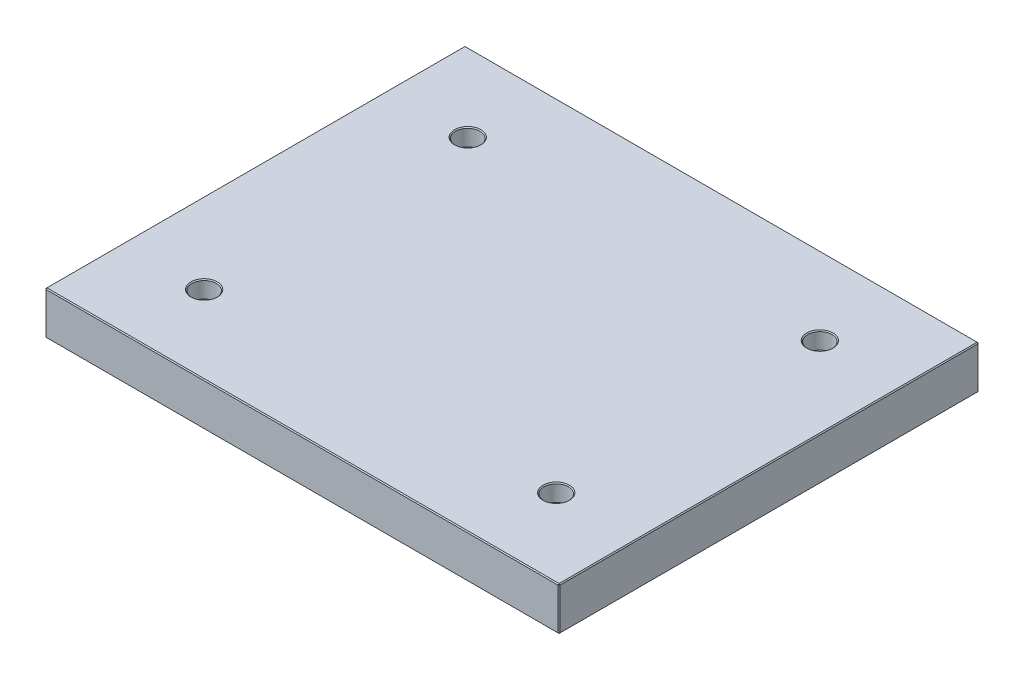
ISO-10303-21;
HEADER;
FILE_DESCRIPTION(('STEP AP214'),'2;1');
FILE_NAME('part.step','',(''),(''),'','','');
FILE_SCHEMA(('AUTOMOTIVE_DESIGN { 1 0 10303 214 1 1 1 1 }'));
ENDSEC;
DATA;
#1=APPLICATION_CONTEXT('core data for automotive mechanical design processes');
#2=APPLICATION_PROTOCOL_DEFINITION('international standard','automotive_design',2000,#1);
#3=PRODUCT_CONTEXT('',#1,'mechanical');
#4=PRODUCT('Part','Part','',(#3));
#5=PRODUCT_RELATED_PRODUCT_CATEGORY('part','',(#4));
#6=PRODUCT_DEFINITION_FORMATION('','',#4);
#7=PRODUCT_DEFINITION_CONTEXT('part definition',#1,'design');
#8=PRODUCT_DEFINITION('design','',#6,#7);
#9=PRODUCT_DEFINITION_SHAPE('','',#8);
#10=(LENGTH_UNIT() NAMED_UNIT(*) SI_UNIT(.MILLI.,.METRE.));
#11=(NAMED_UNIT(*) PLANE_ANGLE_UNIT() SI_UNIT($,.RADIAN.));
#12=(NAMED_UNIT(*) SI_UNIT($,.STERADIAN.) SOLID_ANGLE_UNIT());
#13=UNCERTAINTY_MEASURE_WITH_UNIT(LENGTH_MEASURE(1.E-05),#10,'distance_accuracy_value','');
#14=(GEOMETRIC_REPRESENTATION_CONTEXT(3) GLOBAL_UNCERTAINTY_ASSIGNED_CONTEXT((#13)) GLOBAL_UNIT_ASSIGNED_CONTEXT((#10,
#11,#12)) REPRESENTATION_CONTEXT('',''));
#15=CARTESIAN_POINT('',(0.,0.,0.));
#16=DIRECTION('',(0.,0.,1.));
#17=DIRECTION('',(1.,0.,0.));
#18=AXIS2_PLACEMENT_3D('',#15,#16,#17);
#19=CARTESIAN_POINT('',(-273.,46.,223.));
#20=DIRECTION('',(1.,0.,0.));
#21=DIRECTION('',(0.,0.,-1.));
#22=AXIS2_PLACEMENT_3D('',#19,#20,#21);
#23=PLANE('',#22);
#24=DIRECTION('',(0.,-1.,0.));
#25=VECTOR('',#24,1.);
#26=CARTESIAN_POINT('',(-273.,46.,-222.));
#27=LINE('',#26,#25);
#28=CARTESIAN_POINT('',(-273.,45.,-222.));
#29=VERTEX_POINT('',#28);
#30=CARTESIAN_POINT('',(-273.,1.,-222.));
#31=VERTEX_POINT('',#30);
#32=EDGE_CURVE('E115',#29,#31,#27,.T.);
#33=ORIENTED_EDGE('',*,*,#32,.T.);
#34=DIRECTION('',(0.,0.,1.));
#35=VECTOR('',#34,1.);
#36=CARTESIAN_POINT('',(-273.,1.,223.));
#37=LINE('',#36,#35);
#38=CARTESIAN_POINT('',(-273.,1.,222.));
#39=VERTEX_POINT('',#38);
#40=EDGE_CURVE('E111',#31,#39,#37,.T.);
#41=ORIENTED_EDGE('',*,*,#40,.T.);
#42=DIRECTION('',(0.,1.,0.));
#43=VECTOR('',#42,1.);
#44=CARTESIAN_POINT('',(-273.,46.,222.));
#45=LINE('',#44,#43);
#46=CARTESIAN_POINT('',(-273.,45.,222.));
#47=VERTEX_POINT('',#46);
#48=EDGE_CURVE('E104',#39,#47,#45,.T.);
#49=ORIENTED_EDGE('',*,*,#48,.T.);
#50=DIRECTION('',(0.,0.,-1.));
#51=VECTOR('',#50,1.);
#52=CARTESIAN_POINT('',(-273.,45.,-223.));
#53=LINE('',#52,#51);
#54=EDGE_CURVE('E108',#47,#29,#53,.T.);
#55=ORIENTED_EDGE('',*,*,#54,.T.);
#56=EDGE_LOOP('',(#33,#41,#49,#55));
#57=FACE_BOUND('',#56,.T.);
#58=ADVANCED_FACE('F16',(#57),#23,.F.);
#59=CARTESIAN_POINT('',(273.,46.,223.));
#60=DIRECTION('',(0.,0.,-1.));
#61=DIRECTION('',(-1.,0.,0.));
#62=AXIS2_PLACEMENT_3D('',#59,#60,#61);
#63=PLANE('',#62);
#64=DIRECTION('',(-1.,0.,0.));
#65=VECTOR('',#64,1.);
#66=CARTESIAN_POINT('',(-273.,45.,223.));
#67=LINE('',#66,#65);
#68=CARTESIAN_POINT('',(272.,45.,223.));
#69=VERTEX_POINT('',#68);
#70=CARTESIAN_POINT('',(-272.,45.,223.));
#71=VERTEX_POINT('',#70);
#72=EDGE_CURVE('E170',#69,#71,#67,.T.);
#73=ORIENTED_EDGE('',*,*,#72,.T.);
#74=DIRECTION('',(0.,-1.,0.));
#75=VECTOR('',#74,1.);
#76=CARTESIAN_POINT('',(-272.,46.,223.));
#77=LINE('',#76,#75);
#78=CARTESIAN_POINT('',(-272.,0.999999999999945,223.));
#79=VERTEX_POINT('',#78);
#80=EDGE_CURVE('E123',#71,#79,#77,.T.);
#81=ORIENTED_EDGE('',*,*,#80,.T.);
#82=DIRECTION('',(1.,0.,0.));
#83=VECTOR('',#82,1.);
#84=CARTESIAN_POINT('',(273.,0.999999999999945,223.));
#85=LINE('',#84,#83);
#86=CARTESIAN_POINT('',(272.,0.999999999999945,223.));
#87=VERTEX_POINT('',#86);
#88=EDGE_CURVE('E174',#79,#87,#85,.T.);
#89=ORIENTED_EDGE('',*,*,#88,.T.);
#90=DIRECTION('',(0.,1.,0.));
#91=VECTOR('',#90,1.);
#92=CARTESIAN_POINT('',(272.,46.,223.));
#93=LINE('',#92,#91);
#94=EDGE_CURVE('E172',#87,#69,#93,.T.);
#95=ORIENTED_EDGE('',*,*,#94,.T.);
#96=EDGE_LOOP('',(#73,#81,#89,#95));
#97=FACE_BOUND('',#96,.T.);
#98=ADVANCED_FACE('F317',(#97),#63,.F.);
#99=CARTESIAN_POINT('',(273.,46.,223.));
#100=DIRECTION('',(-1.,0.,0.));
#101=DIRECTION('',(0.,0.,1.));
#102=AXIS2_PLACEMENT_3D('',#99,#100,#101);
#103=PLANE('',#102);
#104=DIRECTION('',(0.,0.,-1.));
#105=VECTOR('',#104,1.);
#106=CARTESIAN_POINT('',(273.,0.999999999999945,223.));
#107=LINE('',#106,#105);
#108=CARTESIAN_POINT('',(273.,0.999999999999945,222.));
#109=VERTEX_POINT('',#108);
#110=CARTESIAN_POINT('',(273.,0.999999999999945,-222.));
#111=VERTEX_POINT('',#110);
#112=EDGE_CURVE('E165',#109,#111,#107,.T.);
#113=ORIENTED_EDGE('',*,*,#112,.T.);
#114=DIRECTION('',(0.,1.,0.));
#115=VECTOR('',#114,1.);
#116=CARTESIAN_POINT('',(273.,46.,-222.));
#117=LINE('',#116,#115);
#118=CARTESIAN_POINT('',(273.,45.,-222.));
#119=VERTEX_POINT('',#118);
#120=EDGE_CURVE('E167',#111,#119,#117,.T.);
#121=ORIENTED_EDGE('',*,*,#120,.T.);
#122=DIRECTION('',(0.,0.,1.));
#123=VECTOR('',#122,1.);
#124=CARTESIAN_POINT('',(273.,45.,223.));
#125=LINE('',#124,#123);
#126=CARTESIAN_POINT('',(273.,45.,222.));
#127=VERTEX_POINT('',#126);
#128=EDGE_CURVE('E161',#119,#127,#125,.T.);
#129=ORIENTED_EDGE('',*,*,#128,.T.);
#130=DIRECTION('',(0.,-1.,0.));
#131=VECTOR('',#130,1.);
#132=CARTESIAN_POINT('',(273.,46.,222.));
#133=LINE('',#132,#131);
#134=EDGE_CURVE('E163',#127,#109,#133,.T.);
#135=ORIENTED_EDGE('',*,*,#134,.T.);
#136=EDGE_LOOP('',(#113,#121,#129,#135));
#137=FACE_BOUND('',#136,.T.);
#138=ADVANCED_FACE('F323',(#137),#103,.F.);
#139=CARTESIAN_POINT('',(273.,46.,-223.));
#140=DIRECTION('',(0.,0.,1.));
#141=DIRECTION('',(1.,0.,0.));
#142=AXIS2_PLACEMENT_3D('',#139,#140,#141);
#143=PLANE('',#142);
#144=DIRECTION('',(0.,-1.,0.));
#145=VECTOR('',#144,1.);
#146=CARTESIAN_POINT('',(272.,46.,-223.));
#147=LINE('',#146,#145);
#148=CARTESIAN_POINT('',(272.,45.,-223.));
#149=VERTEX_POINT('',#148);
#150=CARTESIAN_POINT('',(272.,0.999999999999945,-223.));
#151=VERTEX_POINT('',#150);
#152=EDGE_CURVE('E154',#149,#151,#147,.T.);
#153=ORIENTED_EDGE('',*,*,#152,.T.);
#154=DIRECTION('',(-1.,0.,0.));
#155=VECTOR('',#154,1.);
#156=CARTESIAN_POINT('',(273.,0.999999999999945,-223.));
#157=LINE('',#156,#155);
#158=CARTESIAN_POINT('',(-272.,0.999999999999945,-223.));
#159=VERTEX_POINT('',#158);
#160=EDGE_CURVE('E159',#151,#159,#157,.T.);
#161=ORIENTED_EDGE('',*,*,#160,.T.);
#162=DIRECTION('',(0.,1.,0.));
#163=VECTOR('',#162,1.);
#164=CARTESIAN_POINT('',(-272.,46.,-223.));
#165=LINE('',#164,#163);
#166=CARTESIAN_POINT('',(-272.,45.,-223.));
#167=VERTEX_POINT('',#166);
#168=EDGE_CURVE('E156',#159,#167,#165,.T.);
#169=ORIENTED_EDGE('',*,*,#168,.T.);
#170=DIRECTION('',(1.,0.,0.));
#171=VECTOR('',#170,1.);
#172=CARTESIAN_POINT('',(273.,45.,-223.));
#173=LINE('',#172,#171);
#174=EDGE_CURVE('E152',#167,#149,#173,.T.);
#175=ORIENTED_EDGE('',*,*,#174,.T.);
#176=EDGE_LOOP('',(#153,#161,#169,#175));
#177=FACE_BOUND('',#176,.T.);
#178=ADVANCED_FACE('F465',(#177),#143,.F.);
#179=CARTESIAN_POINT('',(0.,46.,0.));
#180=DIRECTION('',(0.,1.,0.));
#181=DIRECTION('',(0.,0.,1.));
#182=AXIS2_PLACEMENT_3D('',#179,#180,#181);
#183=PLANE('',#182);
#184=CARTESIAN_POINT('',(-187.,46.,140.));
#185=DIRECTION('',(0.,1.,0.));
#186=DIRECTION('',(0.,0.,1.));
#187=AXIS2_PLACEMENT_3D('',#184,#185,#186);
#188=CIRCLE('',#187,14.);
#189=CARTESIAN_POINT('',(-187.,46.,154.));
#190=VERTEX_POINT('',#189);
#191=EDGE_CURVE('E290',#190,#190,#188,.F.);
#192=ORIENTED_EDGE('',*,*,#191,.T.);
#193=EDGE_LOOP('',(#192));
#194=FACE_BOUND('',#193,.T.);
#195=CARTESIAN_POINT('',(187.,46.,140.));
#196=DIRECTION('',(0.,1.,0.));
#197=DIRECTION('',(0.,0.,1.));
#198=AXIS2_PLACEMENT_3D('',#195,#196,#197);
#199=CIRCLE('',#198,14.0000000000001);
#200=CARTESIAN_POINT('',(187.,46.,154.));
#201=VERTEX_POINT('',#200);
#202=EDGE_CURVE('E287',#201,#201,#199,.F.);
#203=ORIENTED_EDGE('',*,*,#202,.T.);
#204=EDGE_LOOP('',(#203));
#205=FACE_BOUND('',#204,.T.);
#206=CARTESIAN_POINT('',(187.,46.,-140.));
#207=DIRECTION('',(0.,1.,0.));
#208=DIRECTION('',(0.,0.,1.));
#209=AXIS2_PLACEMENT_3D('',#206,#207,#208);
#210=CIRCLE('',#209,14.);
#211=CARTESIAN_POINT('',(187.,46.,-126.));
#212=VERTEX_POINT('',#211);
#213=EDGE_CURVE('E284',#212,#212,#210,.F.);
#214=ORIENTED_EDGE('',*,*,#213,.T.);
#215=EDGE_LOOP('',(#214));
#216=FACE_BOUND('',#215,.T.);
#217=CARTESIAN_POINT('',(-187.,46.,-140.));
#218=DIRECTION('',(0.,1.,0.));
#219=DIRECTION('',(0.,0.,1.));
#220=AXIS2_PLACEMENT_3D('',#217,#218,#219);
#221=CIRCLE('',#220,14.);
#222=CARTESIAN_POINT('',(-187.,46.,-126.));
#223=VERTEX_POINT('',#222);
#224=EDGE_CURVE('E281',#223,#223,#221,.F.);
#225=ORIENTED_EDGE('',*,*,#224,.T.);
#226=EDGE_LOOP('',(#225));
#227=FACE_BOUND('',#226,.T.);
#228=DIRECTION('',(0.,0.,-1.));
#229=VECTOR('',#228,1.);
#230=CARTESIAN_POINT('',(272.,46.,-223.));
#231=LINE('',#230,#229);
#232=CARTESIAN_POINT('',(272.,46.,222.));
#233=VERTEX_POINT('',#232);
#234=CARTESIAN_POINT('',(272.,46.,-222.));
#235=VERTEX_POINT('',#234);
#236=EDGE_CURVE('E31',#233,#235,#231,.T.);
#237=ORIENTED_EDGE('',*,*,#236,.T.);
#238=DIRECTION('',(-1.,0.,0.));
#239=VECTOR('',#238,1.);
#240=CARTESIAN_POINT('',(-273.,46.,-222.));
#241=LINE('',#240,#239);
#242=CARTESIAN_POINT('',(-272.,46.,-222.));
#243=VERTEX_POINT('',#242);
#244=EDGE_CURVE('E190',#235,#243,#241,.T.);
#245=ORIENTED_EDGE('',*,*,#244,.T.);
#246=DIRECTION('',(0.,0.,1.));
#247=VECTOR('',#246,1.);
#248=CARTESIAN_POINT('',(-272.,46.,223.));
#249=LINE('',#248,#247);
#250=CARTESIAN_POINT('',(-272.,46.,222.));
#251=VERTEX_POINT('',#250);
#252=EDGE_CURVE('E186',#243,#251,#249,.T.);
#253=ORIENTED_EDGE('',*,*,#252,.T.);
#254=DIRECTION('',(1.,0.,0.));
#255=VECTOR('',#254,1.);
#256=CARTESIAN_POINT('',(273.,46.,222.));
#257=LINE('',#256,#255);
#258=EDGE_CURVE('E36',#251,#233,#257,.T.);
#259=ORIENTED_EDGE('',*,*,#258,.T.);
#260=EDGE_LOOP('',(#237,#245,#253,#259));
#261=FACE_BOUND('',#260,.T.);
#262=ADVANCED_FACE('F462',(#194,#205,#216,#227,#261),#183,.T.);
#263=CARTESIAN_POINT('',(0.,0.,0.));
#264=DIRECTION('',(0.,1.,0.));
#265=DIRECTION('',(0.,0.,1.));
#266=AXIS2_PLACEMENT_3D('',#263,#264,#265);
#267=PLANE('',#266);
#268=CARTESIAN_POINT('',(187.,0.,-140.));
#269=DIRECTION('',(0.,1.,0.));
#270=DIRECTION('',(0.,0.,1.));
#271=AXIS2_PLACEMENT_3D('',#268,#269,#270);
#272=CIRCLE('',#271,10.);
#273=CARTESIAN_POINT('',(187.,0.,-130.));
#274=VERTEX_POINT('',#273);
#275=EDGE_CURVE('E263',#274,#274,#272,.T.);
#276=ORIENTED_EDGE('',*,*,#275,.T.);
#277=EDGE_LOOP('',(#276));
#278=FACE_BOUND('',#277,.T.);
#279=CARTESIAN_POINT('',(187.,0.,140.));
#280=DIRECTION('',(0.,1.,0.));
#281=DIRECTION('',(0.,0.,1.));
#282=AXIS2_PLACEMENT_3D('',#279,#280,#281);
#283=CIRCLE('',#282,10.);
#284=CARTESIAN_POINT('',(187.,0.,150.));
#285=VERTEX_POINT('',#284);
#286=EDGE_CURVE('E260',#285,#285,#283,.T.);
#287=ORIENTED_EDGE('',*,*,#286,.T.);
#288=EDGE_LOOP('',(#287));
#289=FACE_BOUND('',#288,.T.);
#290=CARTESIAN_POINT('',(-187.,0.,140.));
#291=DIRECTION('',(0.,1.,0.));
#292=DIRECTION('',(0.,0.,1.));
#293=AXIS2_PLACEMENT_3D('',#290,#291,#292);
#294=CIRCLE('',#293,10.);
#295=CARTESIAN_POINT('',(-187.,0.,150.));
#296=VERTEX_POINT('',#295);
#297=EDGE_CURVE('E257',#296,#296,#294,.T.);
#298=ORIENTED_EDGE('',*,*,#297,.T.);
#299=EDGE_LOOP('',(#298));
#300=FACE_BOUND('',#299,.T.);
#301=CARTESIAN_POINT('',(-187.,0.,-140.));
#302=DIRECTION('',(0.,1.,0.));
#303=DIRECTION('',(0.,0.,1.));
#304=AXIS2_PLACEMENT_3D('',#301,#302,#303);
#305=CIRCLE('',#304,10.);
#306=CARTESIAN_POINT('',(-187.,0.,-130.));
#307=VERTEX_POINT('',#306);
#308=EDGE_CURVE('E192',#307,#307,#305,.T.);
#309=ORIENTED_EDGE('',*,*,#308,.T.);
#310=EDGE_LOOP('',(#309));
#311=FACE_BOUND('',#310,.T.);
#312=DIRECTION('',(0.,0.,1.));
#313=VECTOR('',#312,1.);
#314=CARTESIAN_POINT('',(272.,0.,0.));
#315=LINE('',#314,#313);
#316=CARTESIAN_POINT('',(272.,0.,-222.));
#317=VERTEX_POINT('',#316);
#318=CARTESIAN_POINT('',(272.,0.,222.));
#319=VERTEX_POINT('',#318);
#320=EDGE_CURVE('E177',#317,#319,#315,.T.);
#321=ORIENTED_EDGE('',*,*,#320,.T.);
#322=DIRECTION('',(-1.,0.,0.));
#323=VECTOR('',#322,1.);
#324=CARTESIAN_POINT('',(0.,0.,222.));
#325=LINE('',#324,#323);
#326=CARTESIAN_POINT('',(-272.,0.,222.));
#327=VERTEX_POINT('',#326);
#328=EDGE_CURVE('E183',#319,#327,#325,.T.);
#329=ORIENTED_EDGE('',*,*,#328,.T.);
#330=DIRECTION('',(0.,0.,-1.));
#331=VECTOR('',#330,1.);
#332=CARTESIAN_POINT('',(-272.,0.,0.));
#333=LINE('',#332,#331);
#334=CARTESIAN_POINT('',(-272.,0.,-222.));
#335=VERTEX_POINT('',#334);
#336=EDGE_CURVE('E181',#327,#335,#333,.T.);
#337=ORIENTED_EDGE('',*,*,#336,.T.);
#338=DIRECTION('',(1.,0.,0.));
#339=VECTOR('',#338,1.);
#340=CARTESIAN_POINT('',(0.,0.,-222.));
#341=LINE('',#340,#339);
#342=EDGE_CURVE('E179',#335,#317,#341,.T.);
#343=ORIENTED_EDGE('',*,*,#342,.T.);
#344=EDGE_LOOP('',(#321,#329,#337,#343));
#345=FACE_BOUND('',#344,.T.);
#346=ADVANCED_FACE('F402',(#278,#289,#300,#311,#345),#267,.F.);
#347=CARTESIAN_POINT('',(273.,46.,222.));
#348=DIRECTION('',(-0.707106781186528,0.,-0.707106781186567));
#349=DIRECTION('',(0.,-1.,0.));
#350=AXIS2_PLACEMENT_3D('',#347,#348,#349);
#351=PLANE('',#350);
#352=DIRECTION('',(-0.707106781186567,0.,0.707106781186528));
#353=VECTOR('',#352,1.);
#354=CARTESIAN_POINT('',(272.,45.,223.));
#355=LINE('',#354,#353);
#356=EDGE_CURVE('E141',#69,#127,#355,.F.);
#357=ORIENTED_EDGE('',*,*,#356,.F.);
#358=ORIENTED_EDGE('',*,*,#94,.F.);
#359=DIRECTION('',(0.707106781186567,0.,-0.707106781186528));
#360=VECTOR('',#359,1.);
#361=CARTESIAN_POINT('',(272.,0.999999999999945,223.));
#362=LINE('',#361,#360);
#363=EDGE_CURVE('E144',#109,#87,#362,.F.);
#364=ORIENTED_EDGE('',*,*,#363,.F.);
#365=ORIENTED_EDGE('',*,*,#134,.F.);
#366=EDGE_LOOP('',(#357,#358,#364,#365));
#367=FACE_BOUND('',#366,.T.);
#368=ADVANCED_FACE('F398',(#367),#351,.F.);
#369=CARTESIAN_POINT('',(272.,45.,223.));
#370=DIRECTION('',(0.577350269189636,0.577350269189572,0.577350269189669));
#371=DIRECTION('',(0.707106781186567,0.,-0.707106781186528));
#372=AXIS2_PLACEMENT_3D('',#369,#370,#371);
#373=PLANE('',#372);
#374=DIRECTION('',(0.,-0.707106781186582,0.707106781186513));
#375=VECTOR('',#374,1.);
#376=CARTESIAN_POINT('',(272.,45.,223.));
#377=LINE('',#376,#375);
#378=EDGE_CURVE('E235',#69,#233,#377,.F.);
#379=ORIENTED_EDGE('',*,*,#378,.F.);
#380=ORIENTED_EDGE('',*,*,#356,.T.);
#381=DIRECTION('',(-0.707106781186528,0.707106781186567,0.));
#382=VECTOR('',#381,1.);
#383=CARTESIAN_POINT('',(272.5,45.5,222.));
#384=LINE('',#383,#382);
#385=EDGE_CURVE('E237',#233,#127,#384,.F.);
#386=ORIENTED_EDGE('',*,*,#385,.F.);
#387=EDGE_LOOP('',(#379,#380,#386));
#388=FACE_BOUND('',#387,.T.);
#389=ADVANCED_FACE('F394',(#388),#373,.T.);
#390=CARTESIAN_POINT('',(272.,0.999999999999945,223.));
#391=DIRECTION('',(0.577350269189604,-0.577350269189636,0.577350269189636));
#392=DIRECTION('',(0.,-0.707106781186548,-0.707106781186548));
#393=AXIS2_PLACEMENT_3D('',#390,#391,#392);
#394=PLANE('',#393);
#395=DIRECTION('',(-0.707106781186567,-0.707106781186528,0.));
#396=VECTOR('',#395,1.);
#397=CARTESIAN_POINT('',(272.5,0.499999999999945,222.));
#398=LINE('',#397,#396);
#399=EDGE_CURVE('E229',#109,#319,#398,.T.);
#400=ORIENTED_EDGE('',*,*,#399,.F.);
#401=ORIENTED_EDGE('',*,*,#363,.T.);
#402=DIRECTION('',(0.,0.707106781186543,0.707106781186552));
#403=VECTOR('',#402,1.);
#404=CARTESIAN_POINT('',(272.,0.999999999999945,223.));
#405=LINE('',#404,#403);
#406=EDGE_CURVE('E232',#319,#87,#405,.T.);
#407=ORIENTED_EDGE('',*,*,#406,.F.);
#408=EDGE_LOOP('',(#400,#401,#407));
#409=FACE_BOUND('',#408,.T.);
#410=ADVANCED_FACE('F390',(#409),#394,.T.);
#411=CARTESIAN_POINT('',(272.,46.,0.));
#412=DIRECTION('',(0.707106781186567,0.707106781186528,0.));
#413=DIRECTION('',(0.,0.,1.));
#414=AXIS2_PLACEMENT_3D('',#411,#412,#413);
#415=PLANE('',#414);
#416=ORIENTED_EDGE('',*,*,#385,.T.);
#417=ORIENTED_EDGE('',*,*,#128,.F.);
#418=DIRECTION('',(0.707106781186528,-0.707106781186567,0.));
#419=VECTOR('',#418,1.);
#420=CARTESIAN_POINT('',(273.,45.,-222.));
#421=LINE('',#420,#419);
#422=EDGE_CURVE('E224',#235,#119,#421,.T.);
#423=ORIENTED_EDGE('',*,*,#422,.F.);
#424=ORIENTED_EDGE('',*,*,#236,.F.);
#425=EDGE_LOOP('',(#416,#417,#423,#424));
#426=FACE_BOUND('',#425,.T.);
#427=ADVANCED_FACE('F386',(#426),#415,.T.);
#428=CARTESIAN_POINT('',(0.,46.,222.));
#429=DIRECTION('',(0.,0.707106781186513,0.707106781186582));
#430=DIRECTION('',(-1.,0.,0.));
#431=AXIS2_PLACEMENT_3D('',#428,#429,#430);
#432=PLANE('',#431);
#433=ORIENTED_EDGE('',*,*,#378,.T.);
#434=ORIENTED_EDGE('',*,*,#258,.F.);
#435=DIRECTION('',(0.,0.707106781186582,-0.707106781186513));
#436=VECTOR('',#435,1.);
#437=CARTESIAN_POINT('',(-272.,45.5,222.5));
#438=LINE('',#437,#436);
#439=EDGE_CURVE('E127',#71,#251,#438,.T.);
#440=ORIENTED_EDGE('',*,*,#439,.F.);
#441=ORIENTED_EDGE('',*,*,#72,.F.);
#442=EDGE_LOOP('',(#433,#434,#440,#441));
#443=FACE_BOUND('',#442,.T.);
#444=ADVANCED_FACE('F383',(#443),#432,.T.);
#445=CARTESIAN_POINT('',(-272.,46.,223.));
#446=DIRECTION('',(0.707106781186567,0.,-0.707106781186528));
#447=DIRECTION('',(0.,-1.,0.));
#448=AXIS2_PLACEMENT_3D('',#445,#446,#447);
#449=PLANE('',#448);
#450=DIRECTION('',(0.707106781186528,0.,0.707106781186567));
#451=VECTOR('',#450,1.);
#452=CARTESIAN_POINT('',(-272.,0.999999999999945,223.));
#453=LINE('',#452,#451);
#454=EDGE_CURVE('E128',#79,#39,#453,.F.);
#455=ORIENTED_EDGE('',*,*,#454,.F.);
#456=ORIENTED_EDGE('',*,*,#80,.F.);
#457=DIRECTION('',(-0.707106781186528,0.,-0.707106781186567));
#458=VECTOR('',#457,1.);
#459=CARTESIAN_POINT('',(-273.,45.,222.));
#460=LINE('',#459,#458);
#461=EDGE_CURVE('E119',#47,#71,#460,.F.);
#462=ORIENTED_EDGE('',*,*,#461,.F.);
#463=ORIENTED_EDGE('',*,*,#48,.F.);
#464=EDGE_LOOP('',(#455,#456,#462,#463));
#465=FACE_BOUND('',#464,.T.);
#466=ADVANCED_FACE('F121',(#465),#449,.F.);
#467=CARTESIAN_POINT('',(273.,0.999999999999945,223.));
#468=DIRECTION('',(0.,0.707106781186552,-0.707106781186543));
#469=DIRECTION('',(1.,0.,0.));
#470=AXIS2_PLACEMENT_3D('',#467,#468,#469);
#471=PLANE('',#470);
#472=ORIENTED_EDGE('',*,*,#406,.T.);
#473=ORIENTED_EDGE('',*,*,#88,.F.);
#474=DIRECTION('',(0.,-0.707106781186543,-0.707106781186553));
#475=VECTOR('',#474,1.);
#476=CARTESIAN_POINT('',(-272.,0.999999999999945,223.));
#477=LINE('',#476,#475);
#478=EDGE_CURVE('E220',#327,#79,#477,.F.);
#479=ORIENTED_EDGE('',*,*,#478,.F.);
#480=ORIENTED_EDGE('',*,*,#328,.F.);
#481=EDGE_LOOP('',(#472,#473,#479,#480));
#482=FACE_BOUND('',#481,.T.);
#483=ADVANCED_FACE('F376',(#482),#471,.F.);
#484=CARTESIAN_POINT('',(273.,0.999999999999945,223.));
#485=DIRECTION('',(-0.707106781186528,0.707106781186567,0.));
#486=DIRECTION('',(0.,0.,-1.));
#487=AXIS2_PLACEMENT_3D('',#484,#485,#486);
#488=PLANE('',#487);
#489=ORIENTED_EDGE('',*,*,#399,.T.);
#490=ORIENTED_EDGE('',*,*,#320,.F.);
#491=DIRECTION('',(0.707106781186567,0.707106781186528,0.));
#492=VECTOR('',#491,1.);
#493=CARTESIAN_POINT('',(272.5,0.499999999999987,-222.));
#494=LINE('',#493,#492);
#495=EDGE_CURVE('E217',#111,#317,#494,.F.);
#496=ORIENTED_EDGE('',*,*,#495,.F.);
#497=ORIENTED_EDGE('',*,*,#112,.F.);
#498=EDGE_LOOP('',(#489,#490,#496,#497));
#499=FACE_BOUND('',#498,.T.);
#500=ADVANCED_FACE('F372',(#499),#488,.F.);
#501=CARTESIAN_POINT('',(272.,46.,-223.));
#502=DIRECTION('',(-0.707106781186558,0.,0.707106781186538));
#503=DIRECTION('',(0.,-1.,0.));
#504=AXIS2_PLACEMENT_3D('',#501,#502,#503);
#505=PLANE('',#504);
#506=DIRECTION('',(0.707106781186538,0.,0.707106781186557));
#507=VECTOR('',#506,1.);
#508=CARTESIAN_POINT('',(273.,45.,-222.));
#509=LINE('',#508,#507);
#510=EDGE_CURVE('E226',#119,#149,#509,.F.);
#511=ORIENTED_EDGE('',*,*,#510,.F.);
#512=ORIENTED_EDGE('',*,*,#120,.F.);
#513=DIRECTION('',(-0.707106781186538,0.,-0.707106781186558));
#514=VECTOR('',#513,1.);
#515=CARTESIAN_POINT('',(272.,0.999999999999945,-223.));
#516=LINE('',#515,#514);
#517=EDGE_CURVE('E214',#151,#111,#516,.F.);
#518=ORIENTED_EDGE('',*,*,#517,.F.);
#519=ORIENTED_EDGE('',*,*,#152,.F.);
#520=EDGE_LOOP('',(#511,#512,#518,#519));
#521=FACE_BOUND('',#520,.T.);
#522=ADVANCED_FACE('F368',(#521),#505,.F.);
#523=CARTESIAN_POINT('',(273.,45.,-222.));
#524=DIRECTION('',(0.577350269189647,0.577350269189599,-0.577350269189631));
#525=DIRECTION('',(-0.707106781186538,0.,-0.707106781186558));
#526=AXIS2_PLACEMENT_3D('',#523,#524,#525);
#527=PLANE('',#526);
#528=ORIENTED_EDGE('',*,*,#422,.T.);
#529=ORIENTED_EDGE('',*,*,#510,.T.);
#530=DIRECTION('',(0.,0.707106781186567,0.707106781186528));
#531=VECTOR('',#530,1.);
#532=CARTESIAN_POINT('',(272.,45.5,-222.5));
#533=LINE('',#532,#531);
#534=EDGE_CURVE('E135',#235,#149,#533,.F.);
#535=ORIENTED_EDGE('',*,*,#534,.F.);
#536=EDGE_LOOP('',(#528,#529,#535));
#537=FACE_BOUND('',#536,.T.);
#538=ADVANCED_FACE('F365',(#537),#527,.T.);
#539=CARTESIAN_POINT('',(-273.,45.,222.));
#540=DIRECTION('',(-0.577350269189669,0.577350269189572,0.577350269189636));
#541=DIRECTION('',(0.707106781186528,0.,0.707106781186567));
#542=AXIS2_PLACEMENT_3D('',#539,#540,#541);
#543=PLANE('',#542);
#544=ORIENTED_EDGE('',*,*,#461,.T.);
#545=ORIENTED_EDGE('',*,*,#439,.T.);
#546=DIRECTION('',(-0.707106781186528,-0.707106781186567,0.));
#547=VECTOR('',#546,1.);
#548=CARTESIAN_POINT('',(-273.,45.,222.));
#549=LINE('',#548,#547);
#550=EDGE_CURVE('E131',#47,#251,#549,.F.);
#551=ORIENTED_EDGE('',*,*,#550,.F.);
#552=EDGE_LOOP('',(#544,#545,#551));
#553=FACE_BOUND('',#552,.T.);
#554=ADVANCED_FACE('F132',(#553),#543,.T.);
#555=CARTESIAN_POINT('',(-272.,0.999999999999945,223.));
#556=DIRECTION('',(-0.577350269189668,-0.577350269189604,0.577350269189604));
#557=DIRECTION('',(0.707106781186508,0.,0.707106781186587));
#558=AXIS2_PLACEMENT_3D('',#555,#556,#557);
#559=PLANE('',#558);
#560=ORIENTED_EDGE('',*,*,#478,.T.);
#561=ORIENTED_EDGE('',*,*,#454,.T.);
#562=DIRECTION('',(-0.707106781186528,0.707106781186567,0.));
#563=VECTOR('',#562,1.);
#564=CARTESIAN_POINT('',(-272.5,0.499999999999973,222.));
#565=LINE('',#564,#563);
#566=EDGE_CURVE('E136',#327,#39,#565,.T.);
#567=ORIENTED_EDGE('',*,*,#566,.F.);
#568=EDGE_LOOP('',(#560,#561,#567));
#569=FACE_BOUND('',#568,.T.);
#570=ADVANCED_FACE('F358',(#569),#559,.T.);
#571=CARTESIAN_POINT('',(272.,0.999999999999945,-223.));
#572=DIRECTION('',(0.577350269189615,-0.577350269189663,-0.577350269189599));
#573=DIRECTION('',(0.707106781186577,0.707106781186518,0.));
#574=AXIS2_PLACEMENT_3D('',#571,#572,#573);
#575=PLANE('',#574);
#576=ORIENTED_EDGE('',*,*,#517,.T.);
#577=ORIENTED_EDGE('',*,*,#495,.T.);
#578=DIRECTION('',(0.,-0.707106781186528,0.707106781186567));
#579=VECTOR('',#578,1.);
#580=CARTESIAN_POINT('',(272.,0.999999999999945,-223.));
#581=LINE('',#580,#579);
#582=EDGE_CURVE('E207',#151,#317,#581,.T.);
#583=ORIENTED_EDGE('',*,*,#582,.F.);
#584=EDGE_LOOP('',(#576,#577,#583));
#585=FACE_BOUND('',#584,.T.);
#586=ADVANCED_FACE('F354',(#585),#575,.T.);
#587=CARTESIAN_POINT('',(0.,46.,-222.));
#588=DIRECTION('',(0.,0.707106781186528,-0.707106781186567));
#589=DIRECTION('',(1.,0.,0.));
#590=AXIS2_PLACEMENT_3D('',#587,#588,#589);
#591=PLANE('',#590);
#592=ORIENTED_EDGE('',*,*,#534,.T.);
#593=ORIENTED_EDGE('',*,*,#174,.F.);
#594=DIRECTION('',(0.,-0.707106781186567,-0.707106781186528));
#595=VECTOR('',#594,1.);
#596=CARTESIAN_POINT('',(-272.,45.,-223.));
#597=LINE('',#596,#595);
#598=EDGE_CURVE('E204',#243,#167,#597,.T.);
#599=ORIENTED_EDGE('',*,*,#598,.F.);
#600=ORIENTED_EDGE('',*,*,#244,.F.);
#601=EDGE_LOOP('',(#592,#593,#599,#600));
#602=FACE_BOUND('',#601,.T.);
#603=ADVANCED_FACE('F351',(#602),#591,.T.);
#604=CARTESIAN_POINT('',(-272.,46.,0.));
#605=DIRECTION('',(-0.707106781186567,0.707106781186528,0.));
#606=DIRECTION('',(0.,0.,-1.));
#607=AXIS2_PLACEMENT_3D('',#604,#605,#606);
#608=PLANE('',#607);
#609=ORIENTED_EDGE('',*,*,#550,.T.);
#610=ORIENTED_EDGE('',*,*,#252,.F.);
#611=DIRECTION('',(0.707106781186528,0.707106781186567,0.));
#612=VECTOR('',#611,1.);
#613=CARTESIAN_POINT('',(-272.5,45.5,-222.));
#614=LINE('',#613,#612);
#615=EDGE_CURVE('E139',#29,#243,#614,.T.);
#616=ORIENTED_EDGE('',*,*,#615,.F.);
#617=ORIENTED_EDGE('',*,*,#54,.F.);
#618=EDGE_LOOP('',(#609,#610,#616,#617));
#619=FACE_BOUND('',#618,.T.);
#620=ADVANCED_FACE('F138',(#619),#608,.T.);
#621=CARTESIAN_POINT('',(-273.,1.,223.));
#622=DIRECTION('',(0.707106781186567,0.707106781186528,0.));
#623=DIRECTION('',(0.,0.,1.));
#624=AXIS2_PLACEMENT_3D('',#621,#622,#623);
#625=PLANE('',#624);
#626=ORIENTED_EDGE('',*,*,#566,.T.);
#627=ORIENTED_EDGE('',*,*,#40,.F.);
#628=DIRECTION('',(0.707106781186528,-0.707106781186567,0.));
#629=VECTOR('',#628,1.);
#630=CARTESIAN_POINT('',(-273.,1.,-222.));
#631=LINE('',#630,#629);
#632=EDGE_CURVE('E200',#335,#31,#631,.F.);
#633=ORIENTED_EDGE('',*,*,#632,.F.);
#634=ORIENTED_EDGE('',*,*,#336,.F.);
#635=EDGE_LOOP('',(#626,#627,#633,#634));
#636=FACE_BOUND('',#635,.T.);
#637=ADVANCED_FACE('F344',(#636),#625,.F.);
#638=CARTESIAN_POINT('',(273.,0.999999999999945,-223.));
#639=DIRECTION('',(0.,0.707106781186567,0.707106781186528));
#640=DIRECTION('',(-1.,0.,0.));
#641=AXIS2_PLACEMENT_3D('',#638,#639,#640);
#642=PLANE('',#641);
#643=ORIENTED_EDGE('',*,*,#582,.T.);
#644=ORIENTED_EDGE('',*,*,#342,.F.);
#645=DIRECTION('',(0.,0.707106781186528,-0.707106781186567));
#646=VECTOR('',#645,1.);
#647=CARTESIAN_POINT('',(-272.,0.499999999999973,-222.5));
#648=LINE('',#647,#646);
#649=EDGE_CURVE('E197',#159,#335,#648,.F.);
#650=ORIENTED_EDGE('',*,*,#649,.F.);
#651=ORIENTED_EDGE('',*,*,#160,.F.);
#652=EDGE_LOOP('',(#643,#644,#650,#651));
#653=FACE_BOUND('',#652,.T.);
#654=ADVANCED_FACE('F340',(#653),#642,.F.);
#655=CARTESIAN_POINT('',(-272.,45.,-223.));
#656=DIRECTION('',(-0.577350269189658,0.577350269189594,-0.577350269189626));
#657=DIRECTION('',(-0.707106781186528,0.,0.707106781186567));
#658=AXIS2_PLACEMENT_3D('',#655,#656,#657);
#659=PLANE('',#658);
#660=ORIENTED_EDGE('',*,*,#615,.T.);
#661=ORIENTED_EDGE('',*,*,#598,.T.);
#662=DIRECTION('',(0.707106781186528,0.,-0.707106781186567));
#663=VECTOR('',#662,1.);
#664=CARTESIAN_POINT('',(-272.,45.,-223.));
#665=LINE('',#664,#663);
#666=EDGE_CURVE('E195',#29,#167,#665,.T.);
#667=ORIENTED_EDGE('',*,*,#666,.F.);
#668=EDGE_LOOP('',(#660,#661,#667));
#669=FACE_BOUND('',#668,.T.);
#670=ADVANCED_FACE('F336',(#669),#659,.T.);
#671=CARTESIAN_POINT('',(-273.,1.,-222.));
#672=DIRECTION('',(-0.577350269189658,-0.577350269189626,-0.577350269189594));
#673=DIRECTION('',(0.707106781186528,-0.707106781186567,0.));
#674=AXIS2_PLACEMENT_3D('',#671,#672,#673);
#675=PLANE('',#674);
#676=ORIENTED_EDGE('',*,*,#649,.T.);
#677=ORIENTED_EDGE('',*,*,#632,.T.);
#678=DIRECTION('',(-0.707106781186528,0.,0.707106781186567));
#679=VECTOR('',#678,1.);
#680=CARTESIAN_POINT('',(-273.,1.,-222.));
#681=LINE('',#680,#679);
#682=EDGE_CURVE('E193',#159,#31,#681,.T.);
#683=ORIENTED_EDGE('',*,*,#682,.F.);
#684=EDGE_LOOP('',(#676,#677,#683));
#685=FACE_BOUND('',#684,.T.);
#686=ADVANCED_FACE('F332',(#685),#675,.T.);
#687=CARTESIAN_POINT('',(-273.,46.,-222.));
#688=DIRECTION('',(0.707106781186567,0.,0.707106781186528));
#689=DIRECTION('',(0.,-1.,0.));
#690=AXIS2_PLACEMENT_3D('',#687,#688,#689);
#691=PLANE('',#690);
#692=ORIENTED_EDGE('',*,*,#666,.T.);
#693=ORIENTED_EDGE('',*,*,#168,.F.);
#694=ORIENTED_EDGE('',*,*,#682,.T.);
#695=ORIENTED_EDGE('',*,*,#32,.F.);
#696=EDGE_LOOP('',(#692,#693,#694,#695));
#697=FACE_BOUND('',#696,.T.);
#698=ADVANCED_FACE('F328',(#697),#691,.F.);
#699=CARTESIAN_POINT('',(-187.,28.,-140.));
#700=DIRECTION('',(0.,1.,0.));
#701=DIRECTION('',(0.,0.,1.));
#702=AXIS2_PLACEMENT_3D('',#699,#700,#701);
#703=CYLINDRICAL_SURFACE('',#702,13.);
#704=CARTESIAN_POINT('',(-187.,45.,-140.));
#705=DIRECTION('',(0.,1.,0.));
#706=DIRECTION('',(0.,0.,1.));
#707=AXIS2_PLACEMENT_3D('',#704,#705,#706);
#708=CIRCLE('',#707,13.);
#709=CARTESIAN_POINT('',(-187.,45.,-127.));
#710=VERTEX_POINT('',#709);
#711=EDGE_CURVE('E10',#710,#710,#708,.T.);
#712=ORIENTED_EDGE('',*,*,#711,.T.);
#713=EDGE_LOOP('',(#712));
#714=FACE_BOUND('',#713,.T.);
#715=CARTESIAN_POINT('',(-187.,28.,-140.));
#716=DIRECTION('',(0.,1.,0.));
#717=DIRECTION('',(0.,0.,1.));
#718=AXIS2_PLACEMENT_3D('',#715,#716,#717);
#719=CIRCLE('',#718,13.);
#720=CARTESIAN_POINT('',(-187.,28.,-127.));
#721=VERTEX_POINT('',#720);
#722=EDGE_CURVE('E147',#721,#721,#719,.T.);
#723=ORIENTED_EDGE('',*,*,#722,.F.);
#724=EDGE_LOOP('',(#723));
#725=FACE_BOUND('',#724,.T.);
#726=ADVANCED_FACE('F331',(#714,#725),#703,.F.);
#727=CARTESIAN_POINT('',(-187.,28.,-140.));
#728=DIRECTION('',(0.,1.,0.));
#729=DIRECTION('',(0.,0.,1.));
#730=AXIS2_PLACEMENT_3D('',#727,#728,#729);
#731=PLANE('',#730);
#732=CARTESIAN_POINT('',(-187.,28.,-140.));
#733=DIRECTION('',(0.,1.,0.));
#734=DIRECTION('',(0.,0.,1.));
#735=AXIS2_PLACEMENT_3D('',#732,#733,#734);
#736=CIRCLE('',#735,9.);
#737=CARTESIAN_POINT('',(-187.,28.,-131.));
#738=VERTEX_POINT('',#737);
#739=EDGE_CURVE('E251',#738,#738,#736,.T.);
#740=ORIENTED_EDGE('',*,*,#739,.F.);
#741=EDGE_LOOP('',(#740));
#742=FACE_BOUND('',#741,.T.);
#743=ORIENTED_EDGE('',*,*,#722,.T.);
#744=EDGE_LOOP('',(#743));
#745=FACE_BOUND('',#744,.T.);
#746=ADVANCED_FACE('F450',(#742,#745),#731,.T.);
#747=CARTESIAN_POINT('',(187.,28.,-140.));
#748=DIRECTION('',(0.,1.,0.));
#749=DIRECTION('',(0.,0.,1.));
#750=AXIS2_PLACEMENT_3D('',#747,#748,#749);
#751=CYLINDRICAL_SURFACE('',#750,13.);
#752=CARTESIAN_POINT('',(187.,45.,-140.));
#753=DIRECTION('',(0.,1.,0.));
#754=DIRECTION('',(0.,0.,1.));
#755=AXIS2_PLACEMENT_3D('',#752,#753,#754);
#756=CIRCLE('',#755,13.);
#757=CARTESIAN_POINT('',(187.,45.,-127.));
#758=VERTEX_POINT('',#757);
#759=EDGE_CURVE('E24',#758,#758,#756,.T.);
#760=ORIENTED_EDGE('',*,*,#759,.T.);
#761=EDGE_LOOP('',(#760));
#762=FACE_BOUND('',#761,.T.);
#763=CARTESIAN_POINT('',(187.,28.,-140.));
#764=DIRECTION('',(0.,1.,0.));
#765=DIRECTION('',(0.,0.,1.));
#766=AXIS2_PLACEMENT_3D('',#763,#764,#765);
#767=CIRCLE('',#766,13.);
#768=CARTESIAN_POINT('',(187.,28.,-127.));
#769=VERTEX_POINT('',#768);
#770=EDGE_CURVE('E441',#769,#769,#767,.T.);
#771=ORIENTED_EDGE('',*,*,#770,.F.);
#772=EDGE_LOOP('',(#771));
#773=FACE_BOUND('',#772,.T.);
#774=ADVANCED_FACE('F298',(#762,#773),#751,.F.);
#775=CARTESIAN_POINT('',(187.,28.,-140.));
#776=DIRECTION('',(0.,1.,0.));
#777=DIRECTION('',(0.,0.,1.));
#778=AXIS2_PLACEMENT_3D('',#775,#776,#777);
#779=PLANE('',#778);
#780=CARTESIAN_POINT('',(187.,28.,-140.));
#781=DIRECTION('',(0.,1.,0.));
#782=DIRECTION('',(0.,0.,1.));
#783=AXIS2_PLACEMENT_3D('',#780,#781,#782);
#784=CIRCLE('',#783,9.);
#785=CARTESIAN_POINT('',(187.,28.,-131.));
#786=VERTEX_POINT('',#785);
#787=EDGE_CURVE('E248',#786,#786,#784,.T.);
#788=ORIENTED_EDGE('',*,*,#787,.F.);
#789=EDGE_LOOP('',(#788));
#790=FACE_BOUND('',#789,.T.);
#791=ORIENTED_EDGE('',*,*,#770,.T.);
#792=EDGE_LOOP('',(#791));
#793=FACE_BOUND('',#792,.T.);
#794=ADVANCED_FACE('F738',(#790,#793),#779,.T.);
#795=CARTESIAN_POINT('',(187.,28.,140.));
#796=DIRECTION('',(0.,1.,0.));
#797=DIRECTION('',(0.,0.,1.));
#798=AXIS2_PLACEMENT_3D('',#795,#796,#797);
#799=CYLINDRICAL_SURFACE('',#798,13.);
#800=CARTESIAN_POINT('',(187.,45.,140.));
#801=DIRECTION('',(0.,1.,0.));
#802=DIRECTION('',(0.,0.,1.));
#803=AXIS2_PLACEMENT_3D('',#800,#801,#802);
#804=CIRCLE('',#803,13.);
#805=CARTESIAN_POINT('',(187.,45.,153.));
#806=VERTEX_POINT('',#805);
#807=EDGE_CURVE('E293',#806,#806,#804,.T.);
#808=ORIENTED_EDGE('',*,*,#807,.T.);
#809=EDGE_LOOP('',(#808));
#810=FACE_BOUND('',#809,.T.);
#811=CARTESIAN_POINT('',(187.,28.,140.));
#812=DIRECTION('',(0.,1.,0.));
#813=DIRECTION('',(0.,0.,1.));
#814=AXIS2_PLACEMENT_3D('',#811,#812,#813);
#815=CIRCLE('',#814,13.);
#816=CARTESIAN_POINT('',(187.,28.,153.));
#817=VERTEX_POINT('',#816);
#818=EDGE_CURVE('E439',#817,#817,#815,.T.);
#819=ORIENTED_EDGE('',*,*,#818,.F.);
#820=EDGE_LOOP('',(#819));
#821=FACE_BOUND('',#820,.T.);
#822=ADVANCED_FACE('F730',(#810,#821),#799,.F.);
#823=CARTESIAN_POINT('',(187.,28.,140.));
#824=DIRECTION('',(0.,1.,0.));
#825=DIRECTION('',(0.,0.,1.));
#826=AXIS2_PLACEMENT_3D('',#823,#824,#825);
#827=PLANE('',#826);
#828=CARTESIAN_POINT('',(187.,28.,140.));
#829=DIRECTION('',(0.,1.,0.));
#830=DIRECTION('',(0.,0.,1.));
#831=AXIS2_PLACEMENT_3D('',#828,#829,#830);
#832=CIRCLE('',#831,9.);
#833=CARTESIAN_POINT('',(187.,28.,149.));
#834=VERTEX_POINT('',#833);
#835=EDGE_CURVE('E245',#834,#834,#832,.T.);
#836=ORIENTED_EDGE('',*,*,#835,.F.);
#837=EDGE_LOOP('',(#836));
#838=FACE_BOUND('',#837,.T.);
#839=ORIENTED_EDGE('',*,*,#818,.T.);
#840=EDGE_LOOP('',(#839));
#841=FACE_BOUND('',#840,.T.);
#842=ADVANCED_FACE('F434',(#838,#841),#827,.T.);
#843=CARTESIAN_POINT('',(-187.,28.,140.));
#844=DIRECTION('',(0.,1.,0.));
#845=DIRECTION('',(0.,0.,1.));
#846=AXIS2_PLACEMENT_3D('',#843,#844,#845);
#847=CYLINDRICAL_SURFACE('',#846,13.);
#848=CARTESIAN_POINT('',(-187.,45.,140.));
#849=DIRECTION('',(0.,1.,0.));
#850=DIRECTION('',(0.,0.,1.));
#851=AXIS2_PLACEMENT_3D('',#848,#849,#850);
#852=CIRCLE('',#851,13.);
#853=CARTESIAN_POINT('',(-187.,45.,153.));
#854=VERTEX_POINT('',#853);
#855=EDGE_CURVE('E278',#854,#854,#852,.T.);
#856=ORIENTED_EDGE('',*,*,#855,.T.);
#857=EDGE_LOOP('',(#856));
#858=FACE_BOUND('',#857,.T.);
#859=CARTESIAN_POINT('',(-187.,28.,140.));
#860=DIRECTION('',(0.,1.,0.));
#861=DIRECTION('',(0.,0.,1.));
#862=AXIS2_PLACEMENT_3D('',#859,#860,#861);
#863=CIRCLE('',#862,13.);
#864=CARTESIAN_POINT('',(-187.,28.,153.));
#865=VERTEX_POINT('',#864);
#866=EDGE_CURVE('E254',#865,#865,#863,.T.);
#867=ORIENTED_EDGE('',*,*,#866,.F.);
#868=EDGE_LOOP('',(#867));
#869=FACE_BOUND('',#868,.T.);
#870=ADVANCED_FACE('F430',(#858,#869),#847,.F.);
#871=CARTESIAN_POINT('',(-187.,28.,140.));
#872=DIRECTION('',(0.,1.,0.));
#873=DIRECTION('',(0.,0.,1.));
#874=AXIS2_PLACEMENT_3D('',#871,#872,#873);
#875=PLANE('',#874);
#876=CARTESIAN_POINT('',(-187.,28.,140.));
#877=DIRECTION('',(0.,1.,0.));
#878=DIRECTION('',(0.,0.,1.));
#879=AXIS2_PLACEMENT_3D('',#876,#877,#878);
#880=CIRCLE('',#879,9.);
#881=CARTESIAN_POINT('',(-187.,28.,149.));
#882=VERTEX_POINT('',#881);
#883=EDGE_CURVE('E242',#882,#882,#880,.T.);
#884=ORIENTED_EDGE('',*,*,#883,.F.);
#885=EDGE_LOOP('',(#884));
#886=FACE_BOUND('',#885,.T.);
#887=ORIENTED_EDGE('',*,*,#866,.T.);
#888=EDGE_LOOP('',(#887));
#889=FACE_BOUND('',#888,.T.);
#890=ADVANCED_FACE('F433',(#886,#889),#875,.T.);
#891=CARTESIAN_POINT('',(-187.,0.,140.));
#892=DIRECTION('',(0.,1.,0.));
#893=DIRECTION('',(0.,0.,1.));
#894=AXIS2_PLACEMENT_3D('',#891,#892,#893);
#895=CYLINDRICAL_SURFACE('',#894,9.);
#896=CARTESIAN_POINT('',(-187.,0.999999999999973,140.));
#897=DIRECTION('',(0.,1.,0.));
#898=DIRECTION('',(0.,0.,1.));
#899=AXIS2_PLACEMENT_3D('',#896,#897,#898);
#900=CIRCLE('',#899,9.);
#901=CARTESIAN_POINT('',(-187.,0.999999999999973,149.));
#902=VERTEX_POINT('',#901);
#903=EDGE_CURVE('E272',#902,#902,#900,.F.);
#904=ORIENTED_EDGE('',*,*,#903,.T.);
#905=EDGE_LOOP('',(#904));
#906=FACE_BOUND('',#905,.T.);
#907=ORIENTED_EDGE('',*,*,#883,.T.);
#908=EDGE_LOOP('',(#907));
#909=FACE_BOUND('',#908,.T.);
#910=ADVANCED_FACE('F705',(#906,#909),#895,.F.);
#911=CARTESIAN_POINT('',(187.,0.,140.));
#912=DIRECTION('',(0.,1.,0.));
#913=DIRECTION('',(0.,0.,1.));
#914=AXIS2_PLACEMENT_3D('',#911,#912,#913);
#915=CYLINDRICAL_SURFACE('',#914,9.);
#916=CARTESIAN_POINT('',(187.,0.999999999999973,140.));
#917=DIRECTION('',(0.,1.,0.));
#918=DIRECTION('',(0.,0.,1.));
#919=AXIS2_PLACEMENT_3D('',#916,#917,#918);
#920=CIRCLE('',#919,9.);
#921=CARTESIAN_POINT('',(187.,0.999999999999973,149.));
#922=VERTEX_POINT('',#921);
#923=EDGE_CURVE('E269',#922,#922,#920,.F.);
#924=ORIENTED_EDGE('',*,*,#923,.T.);
#925=EDGE_LOOP('',(#924));
#926=FACE_BOUND('',#925,.T.);
#927=ORIENTED_EDGE('',*,*,#835,.T.);
#928=EDGE_LOOP('',(#927));
#929=FACE_BOUND('',#928,.T.);
#930=ADVANCED_FACE('F697',(#926,#929),#915,.F.);
#931=CARTESIAN_POINT('',(187.,0.,-140.));
#932=DIRECTION('',(0.,1.,0.));
#933=DIRECTION('',(0.,0.,1.));
#934=AXIS2_PLACEMENT_3D('',#931,#932,#933);
#935=CYLINDRICAL_SURFACE('',#934,9.);
#936=CARTESIAN_POINT('',(187.,0.999999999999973,-140.));
#937=DIRECTION('',(0.,1.,0.));
#938=DIRECTION('',(0.,0.,1.));
#939=AXIS2_PLACEMENT_3D('',#936,#937,#938);
#940=CIRCLE('',#939,9.);
#941=CARTESIAN_POINT('',(187.,0.999999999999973,-131.));
#942=VERTEX_POINT('',#941);
#943=EDGE_CURVE('E266',#942,#942,#940,.F.);
#944=ORIENTED_EDGE('',*,*,#943,.T.);
#945=EDGE_LOOP('',(#944));
#946=FACE_BOUND('',#945,.T.);
#947=ORIENTED_EDGE('',*,*,#787,.T.);
#948=EDGE_LOOP('',(#947));
#949=FACE_BOUND('',#948,.T.);
#950=ADVANCED_FACE('F688',(#946,#949),#935,.F.);
#951=CARTESIAN_POINT('',(-187.,0.,-140.));
#952=DIRECTION('',(0.,1.,0.));
#953=DIRECTION('',(0.,0.,1.));
#954=AXIS2_PLACEMENT_3D('',#951,#952,#953);
#955=CYLINDRICAL_SURFACE('',#954,9.);
#956=CARTESIAN_POINT('',(-187.,0.999999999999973,-140.));
#957=DIRECTION('',(0.,1.,0.));
#958=DIRECTION('',(0.,0.,1.));
#959=AXIS2_PLACEMENT_3D('',#956,#957,#958);
#960=CIRCLE('',#959,9.);
#961=CARTESIAN_POINT('',(-187.,0.999999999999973,-131.));
#962=VERTEX_POINT('',#961);
#963=EDGE_CURVE('E275',#962,#962,#960,.F.);
#964=ORIENTED_EDGE('',*,*,#963,.T.);
#965=EDGE_LOOP('',(#964));
#966=FACE_BOUND('',#965,.T.);
#967=ORIENTED_EDGE('',*,*,#739,.T.);
#968=EDGE_LOOP('',(#967));
#969=FACE_BOUND('',#968,.T.);
#970=ADVANCED_FACE('F408',(#966,#969),#955,.F.);
#971=CARTESIAN_POINT('',(187.,0.,-140.));
#972=DIRECTION('',(0.,-1.,0.));
#973=DIRECTION('',(0.,0.,-1.));
#974=AXIS2_PLACEMENT_3D('',#971,#972,#973);
#975=CONICAL_SURFACE('',#974,10.,0.785398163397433);
#976=ORIENTED_EDGE('',*,*,#943,.F.);
#977=EDGE_LOOP('',(#976));
#978=FACE_BOUND('',#977,.T.);
#979=ORIENTED_EDGE('',*,*,#275,.F.);
#980=EDGE_LOOP('',(#979));
#981=FACE_BOUND('',#980,.T.);
#982=ADVANCED_FACE('F404',(#978,#981),#975,.F.);
#983=CARTESIAN_POINT('',(187.,0.,140.));
#984=DIRECTION('',(0.,-1.,0.));
#985=DIRECTION('',(0.,0.,-1.));
#986=AXIS2_PLACEMENT_3D('',#983,#984,#985);
#987=CONICAL_SURFACE('',#986,10.,0.785398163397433);
#988=ORIENTED_EDGE('',*,*,#923,.F.);
#989=EDGE_LOOP('',(#988));
#990=FACE_BOUND('',#989,.T.);
#991=ORIENTED_EDGE('',*,*,#286,.F.);
#992=EDGE_LOOP('',(#991));
#993=FACE_BOUND('',#992,.T.);
#994=ADVANCED_FACE('F407',(#990,#993),#987,.F.);
#995=CARTESIAN_POINT('',(-187.,0.,140.));
#996=DIRECTION('',(0.,-1.,0.));
#997=DIRECTION('',(0.,0.,-1.));
#998=AXIS2_PLACEMENT_3D('',#995,#996,#997);
#999=CONICAL_SURFACE('',#998,10.,0.785398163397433);
#1000=ORIENTED_EDGE('',*,*,#903,.F.);
#1001=EDGE_LOOP('',(#1000));
#1002=FACE_BOUND('',#1001,.T.);
#1003=ORIENTED_EDGE('',*,*,#297,.F.);
#1004=EDGE_LOOP('',(#1003));
#1005=FACE_BOUND('',#1004,.T.);
#1006=ADVANCED_FACE('F412',(#1002,#1005),#999,.F.);
#1007=CARTESIAN_POINT('',(-187.,0.,-140.));
#1008=DIRECTION('',(0.,-1.,0.));
#1009=DIRECTION('',(0.,0.,-1.));
#1010=AXIS2_PLACEMENT_3D('',#1007,#1008,#1009);
#1011=CONICAL_SURFACE('',#1010,10.,0.785398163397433);
#1012=ORIENTED_EDGE('',*,*,#963,.F.);
#1013=EDGE_LOOP('',(#1012));
#1014=FACE_BOUND('',#1013,.T.);
#1015=ORIENTED_EDGE('',*,*,#308,.F.);
#1016=EDGE_LOOP('',(#1015));
#1017=FACE_BOUND('',#1016,.T.);
#1018=ADVANCED_FACE('F416',(#1014,#1017),#1011,.F.);
#1019=CARTESIAN_POINT('',(-187.,45.,140.));
#1020=DIRECTION('',(0.,1.,0.));
#1021=DIRECTION('',(0.,0.,1.));
#1022=AXIS2_PLACEMENT_3D('',#1019,#1020,#1021);
#1023=CONICAL_SURFACE('',#1022,13.,0.785398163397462);
#1024=ORIENTED_EDGE('',*,*,#191,.F.);
#1025=EDGE_LOOP('',(#1024));
#1026=FACE_BOUND('',#1025,.T.);
#1027=ORIENTED_EDGE('',*,*,#855,.F.);
#1028=EDGE_LOOP('',(#1027));
#1029=FACE_BOUND('',#1028,.T.);
#1030=ADVANCED_FACE('F312',(#1026,#1029),#1023,.F.);
#1031=CARTESIAN_POINT('',(187.,45.,140.));
#1032=DIRECTION('',(0.,1.,0.));
#1033=DIRECTION('',(0.,0.,1.));
#1034=AXIS2_PLACEMENT_3D('',#1031,#1032,#1033);
#1035=CONICAL_SURFACE('',#1034,13.,0.785398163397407);
#1036=ORIENTED_EDGE('',*,*,#202,.F.);
#1037=EDGE_LOOP('',(#1036));
#1038=FACE_BOUND('',#1037,.T.);
#1039=ORIENTED_EDGE('',*,*,#807,.F.);
#1040=EDGE_LOOP('',(#1039));
#1041=FACE_BOUND('',#1040,.T.);
#1042=ADVANCED_FACE('F303',(#1038,#1041),#1035,.F.);
#1043=CARTESIAN_POINT('',(187.,45.,-140.));
#1044=DIRECTION('',(0.,1.,0.));
#1045=DIRECTION('',(0.,0.,1.));
#1046=AXIS2_PLACEMENT_3D('',#1043,#1044,#1045);
#1047=CONICAL_SURFACE('',#1046,13.,0.785398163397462);
#1048=ORIENTED_EDGE('',*,*,#213,.F.);
#1049=EDGE_LOOP('',(#1048));
#1050=FACE_BOUND('',#1049,.T.);
#1051=ORIENTED_EDGE('',*,*,#759,.F.);
#1052=EDGE_LOOP('',(#1051));
#1053=FACE_BOUND('',#1052,.T.);
#1054=ADVANCED_FACE('F301',(#1050,#1053),#1047,.F.);
#1055=CARTESIAN_POINT('',(-187.,45.,-140.));
#1056=DIRECTION('',(0.,1.,0.));
#1057=DIRECTION('',(0.,0.,1.));
#1058=AXIS2_PLACEMENT_3D('',#1055,#1056,#1057);
#1059=CONICAL_SURFACE('',#1058,13.,0.785398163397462);
#1060=ORIENTED_EDGE('',*,*,#224,.F.);
#1061=EDGE_LOOP('',(#1060));
#1062=FACE_BOUND('',#1061,.T.);
#1063=ORIENTED_EDGE('',*,*,#711,.F.);
#1064=EDGE_LOOP('',(#1063));
#1065=FACE_BOUND('',#1064,.T.);
#1066=ADVANCED_FACE('F18',(#1062,#1065),#1059,.F.);
#1067=CLOSED_SHELL('',(#58,#98,#138,#178,#262,#346,#368,#389,#410,#427,#444,#466,#483,#500,#522,
#538,#554,#570,#586,#603,#620,#637,#654,#670,#686,#698,#726,#746,#774,#794,#822,#842,#870,#890,
#910,#930,#950,#970,#982,#994,#1006,#1018,#1030,#1042,#1054,#1066));
#1068=MANIFOLD_SOLID_BREP('B1',#1067);
#1069=ADVANCED_BREP_SHAPE_REPRESENTATION('',(#18,#1068),#14);
#1070=SHAPE_DEFINITION_REPRESENTATION(#9,#1069);
ENDSEC;
END-ISO-10303-21;
